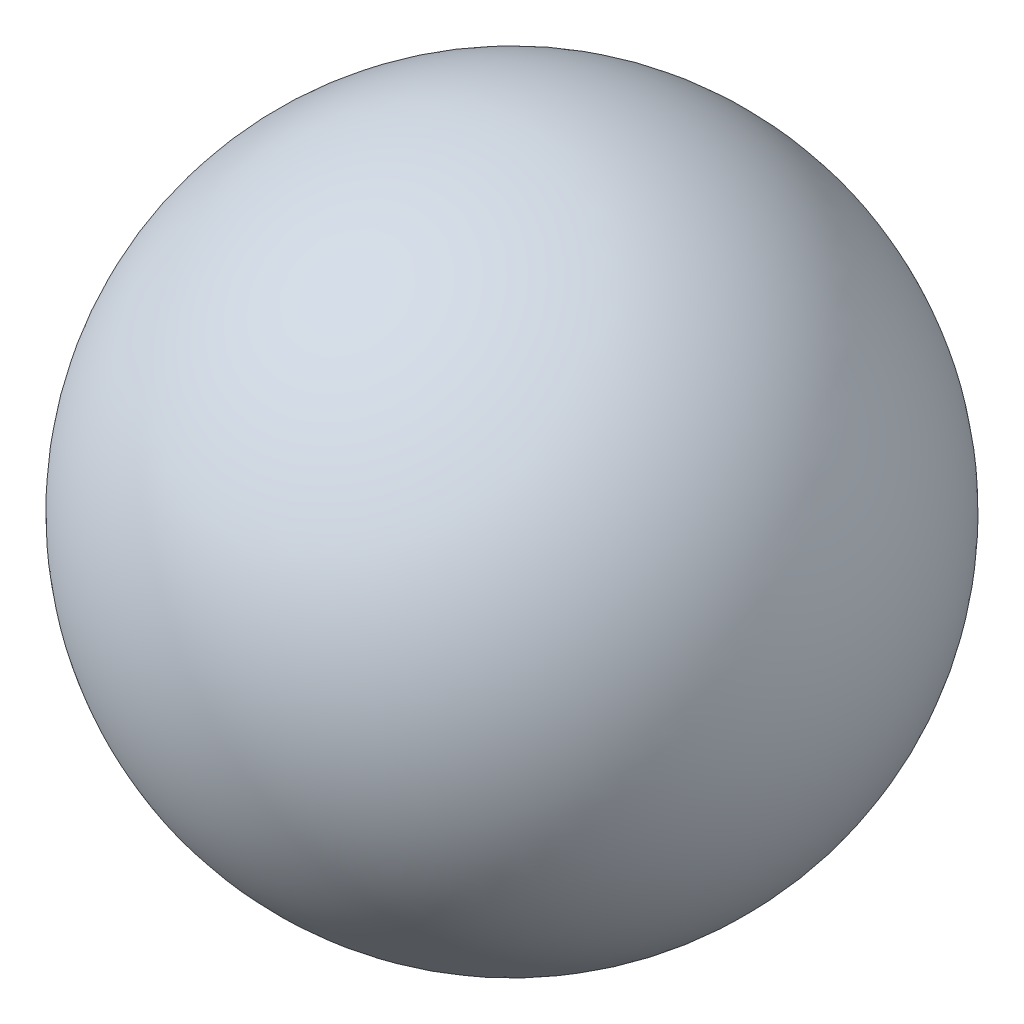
from build123d import *
from build123d.topology import SkipClean


with BuildPart() as part:
    # Sketch 1 → Revolve 2 (revolve)
    with SkipClean():  # the faces are left unmerged after this step: merging them gives an invalid solid
        with BuildSketch(Plane(origin=(0, 0, 0), x_dir=(1, 0, 0), z_dir=(0, 1, 0))):
            with BuildLine():
                ThreePointArc((33.5, 0), (23.68807717, 23.68807717), (0, 33.5))
                Line((0, 33.5), (0, 30))
                ThreePointArc((0, 30), (21.213203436, 21.213203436), (30, 0))
                ThreePointArc((30, 0), (21.213203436, -21.213203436), (0, -30))
                Line((0, -30), (0, -33.5))
                ThreePointArc((0, -33.5), (23.68807717, -23.68807717), (33.5, 0))
            make_face()
            with BuildLine():
                Line((0, 30), (0, 33.5))
                ThreePointArc((0, 33.5), (-33.5, 0), (0, -33.5))
                Line((0, -33.5), (0, -30))
                ThreePointArc((0, -30), (-30, 0), (0, 30))
            make_face()
        revolve(axis=Axis((0, 0, -33.5), (0, 0, 1)))


solid = part.part
